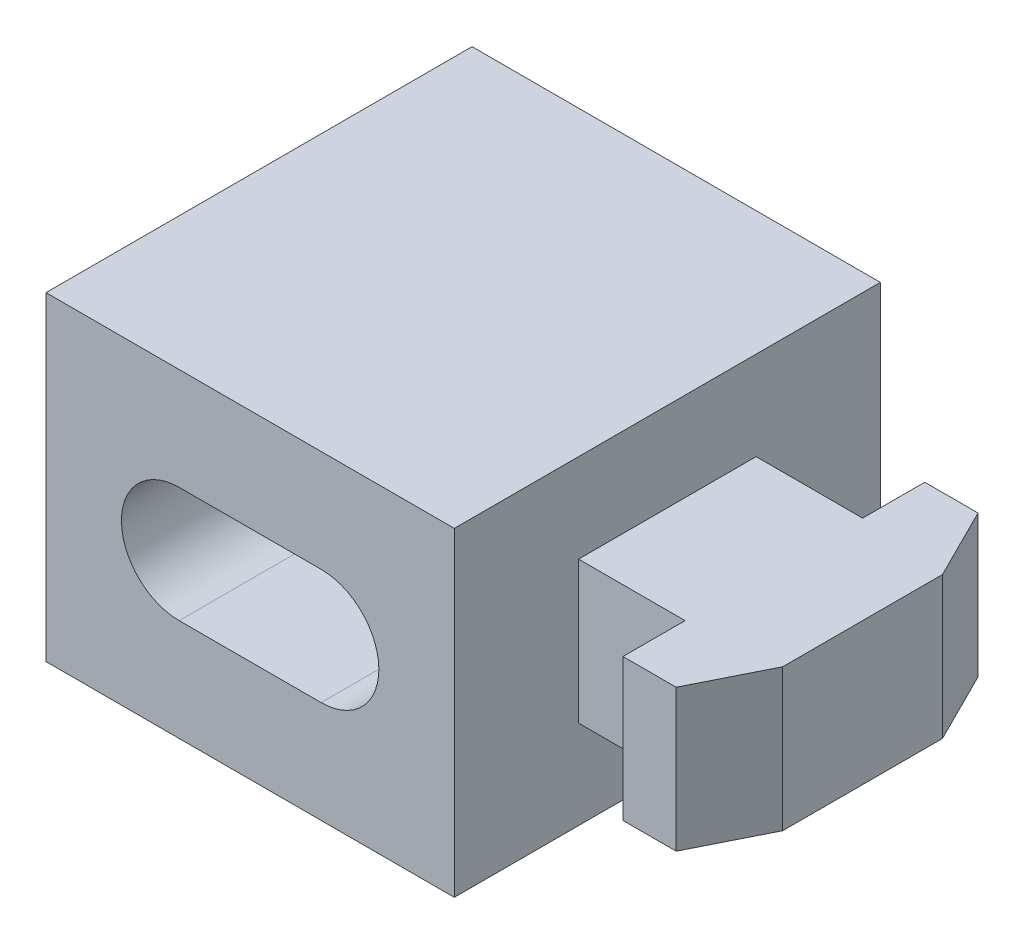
ISO-10303-21;
HEADER;
FILE_DESCRIPTION(('STEP AP214'),'2;1');
FILE_NAME('part.step','',(''),(''),'','','');
FILE_SCHEMA(('AUTOMOTIVE_DESIGN { 1 0 10303 214 1 1 1 1 }'));
ENDSEC;
DATA;
#1=APPLICATION_CONTEXT('core data for automotive mechanical design processes');
#2=APPLICATION_PROTOCOL_DEFINITION('international standard','automotive_design',2000,#1);
#3=PRODUCT_CONTEXT('',#1,'mechanical');
#4=PRODUCT('Part','Part','',(#3));
#5=PRODUCT_RELATED_PRODUCT_CATEGORY('part','',(#4));
#6=PRODUCT_DEFINITION_FORMATION('','',#4);
#7=PRODUCT_DEFINITION_CONTEXT('part definition',#1,'design');
#8=PRODUCT_DEFINITION('design','',#6,#7);
#9=PRODUCT_DEFINITION_SHAPE('','',#8);
#10=(LENGTH_UNIT() NAMED_UNIT(*) SI_UNIT(.MILLI.,.METRE.));
#11=(NAMED_UNIT(*) PLANE_ANGLE_UNIT() SI_UNIT($,.RADIAN.));
#12=(NAMED_UNIT(*) SI_UNIT($,.STERADIAN.) SOLID_ANGLE_UNIT());
#13=UNCERTAINTY_MEASURE_WITH_UNIT(LENGTH_MEASURE(1.E-05),#10,'distance_accuracy_value','');
#14=(GEOMETRIC_REPRESENTATION_CONTEXT(3) GLOBAL_UNCERTAINTY_ASSIGNED_CONTEXT((#13)) GLOBAL_UNIT_ASSIGNED_CONTEXT((#10,
#11,#12)) REPRESENTATION_CONTEXT('',''));
#15=CARTESIAN_POINT('',(0.,0.,0.));
#16=DIRECTION('',(0.,0.,1.));
#17=DIRECTION('',(1.,0.,0.));
#18=AXIS2_PLACEMENT_3D('',#15,#16,#17);
#19=CARTESIAN_POINT('',(22.5,-4.,8.5));
#20=DIRECTION('',(0.,1.,0.));
#21=DIRECTION('',(-1.,0.,0.));
#22=AXIS2_PLACEMENT_3D('',#19,#20,#21);
#23=PLANE('',#22);
#24=DIRECTION('',(0.447213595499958,0.,0.894427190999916));
#25=VECTOR('',#24,1.);
#26=CARTESIAN_POINT('',(22.5,-4.,-4.5));
#27=LINE('',#26,#25);
#28=CARTESIAN_POINT('',(20.5,-4.,-8.5));
#29=VERTEX_POINT('',#28);
#30=CARTESIAN_POINT('',(22.5,-4.,-4.5));
#31=VERTEX_POINT('',#30);
#32=EDGE_CURVE('E205',#29,#31,#27,.T.);
#33=ORIENTED_EDGE('',*,*,#32,.T.);
#34=DIRECTION('',(0.,0.,-1.));
#35=VECTOR('',#34,1.);
#36=CARTESIAN_POINT('',(22.5,-4.,8.5));
#37=LINE('',#36,#35);
#38=CARTESIAN_POINT('',(22.5,-4.,4.5));
#39=VERTEX_POINT('',#38);
#40=EDGE_CURVE('E395',#39,#31,#37,.T.);
#41=ORIENTED_EDGE('',*,*,#40,.F.);
#42=DIRECTION('',(0.447213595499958,0.,-0.894427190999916));
#43=VECTOR('',#42,1.);
#44=CARTESIAN_POINT('',(22.5,-4.,4.5));
#45=LINE('',#44,#43);
#46=CARTESIAN_POINT('',(20.5,-4.,8.5));
#47=VERTEX_POINT('',#46);
#48=EDGE_CURVE('E56',#47,#39,#45,.T.);
#49=ORIENTED_EDGE('',*,*,#48,.F.);
#50=DIRECTION('',(-1.,0.,0.));
#51=VECTOR('',#50,1.);
#52=CARTESIAN_POINT('',(22.5,-4.,8.5));
#53=LINE('',#52,#51);
#54=CARTESIAN_POINT('',(17.5,-4.,8.5));
#55=VERTEX_POINT('',#54);
#56=EDGE_CURVE('E225',#47,#55,#53,.T.);
#57=ORIENTED_EDGE('',*,*,#56,.T.);
#58=DIRECTION('',(0.,0.,1.));
#59=VECTOR('',#58,1.);
#60=CARTESIAN_POINT('',(17.5,-4.,8.5));
#61=LINE('',#60,#59);
#62=CARTESIAN_POINT('',(17.5,-4.,5.));
#63=VERTEX_POINT('',#62);
#64=EDGE_CURVE('E370',#63,#55,#61,.T.);
#65=ORIENTED_EDGE('',*,*,#64,.F.);
#66=DIRECTION('',(1.,0.,0.));
#67=VECTOR('',#66,1.);
#68=CARTESIAN_POINT('',(22.5,-4.,5.));
#69=LINE('',#68,#67);
#70=CARTESIAN_POINT('',(11.5,-4.,5.));
#71=VERTEX_POINT('',#70);
#72=EDGE_CURVE('E377',#71,#63,#69,.T.);
#73=ORIENTED_EDGE('',*,*,#72,.F.);
#74=DIRECTION('',(0.,0.,-1.));
#75=VECTOR('',#74,1.);
#76=CARTESIAN_POINT('',(11.5,-4.,8.5));
#77=LINE('',#76,#75);
#78=CARTESIAN_POINT('',(11.5,-4.,-5.));
#79=VERTEX_POINT('',#78);
#80=EDGE_CURVE('E394',#71,#79,#77,.T.);
#81=ORIENTED_EDGE('',*,*,#80,.T.);
#82=DIRECTION('',(1.,0.,0.));
#83=VECTOR('',#82,1.);
#84=CARTESIAN_POINT('',(22.5,-4.,-5.));
#85=LINE('',#84,#83);
#86=CARTESIAN_POINT('',(17.5,-4.,-5.));
#87=VERTEX_POINT('',#86);
#88=EDGE_CURVE('E388',#79,#87,#85,.T.);
#89=ORIENTED_EDGE('',*,*,#88,.T.);
#90=DIRECTION('',(0.,0.,-1.));
#91=VECTOR('',#90,1.);
#92=CARTESIAN_POINT('',(17.5,-4.,8.5));
#93=LINE('',#92,#91);
#94=CARTESIAN_POINT('',(17.5,-4.,-8.5));
#95=VERTEX_POINT('',#94);
#96=EDGE_CURVE('E224',#87,#95,#93,.T.);
#97=ORIENTED_EDGE('',*,*,#96,.T.);
#98=DIRECTION('',(-1.,0.,0.));
#99=VECTOR('',#98,1.);
#100=CARTESIAN_POINT('',(22.5,-4.,-8.5));
#101=LINE('',#100,#99);
#102=EDGE_CURVE('E218',#29,#95,#101,.T.);
#103=ORIENTED_EDGE('',*,*,#102,.F.);
#104=EDGE_LOOP('',(#33,#41,#49,#57,#65,#73,#81,#89,#97,#103));
#105=FACE_BOUND('',#104,.T.);
#106=ADVANCED_FACE('F34',(#105),#23,.F.);
#107=CARTESIAN_POINT('',(22.5,4.,8.5));
#108=DIRECTION('',(0.,-1.,0.));
#109=DIRECTION('',(1.,0.,0.));
#110=AXIS2_PLACEMENT_3D('',#107,#108,#109);
#111=PLANE('',#110);
#112=DIRECTION('',(0.447213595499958,0.,0.894427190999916));
#113=VECTOR('',#112,1.);
#114=CARTESIAN_POINT('',(27.7,4.00000000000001,5.9));
#115=LINE('',#114,#113);
#116=CARTESIAN_POINT('',(20.5,4.,-8.5));
#117=VERTEX_POINT('',#116);
#118=CARTESIAN_POINT('',(22.5,4.,-4.49999999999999));
#119=VERTEX_POINT('',#118);
#120=EDGE_CURVE('E49',#117,#119,#115,.T.);
#121=ORIENTED_EDGE('',*,*,#120,.F.);
#122=DIRECTION('',(-1.,0.,0.));
#123=VECTOR('',#122,1.);
#124=CARTESIAN_POINT('',(22.5,4.,-8.5));
#125=LINE('',#124,#123);
#126=CARTESIAN_POINT('',(17.5,4.,-8.5));
#127=VERTEX_POINT('',#126);
#128=EDGE_CURVE('E220',#117,#127,#125,.T.);
#129=ORIENTED_EDGE('',*,*,#128,.T.);
#130=DIRECTION('',(0.,0.,-1.));
#131=VECTOR('',#130,1.);
#132=CARTESIAN_POINT('',(17.5,4.,-8.5));
#133=LINE('',#132,#131);
#134=CARTESIAN_POINT('',(17.5,4.,-5.));
#135=VERTEX_POINT('',#134);
#136=EDGE_CURVE('E382',#135,#127,#133,.T.);
#137=ORIENTED_EDGE('',*,*,#136,.F.);
#138=DIRECTION('',(1.,0.,0.));
#139=VECTOR('',#138,1.);
#140=CARTESIAN_POINT('',(11.5,4.,-5.));
#141=LINE('',#140,#139);
#142=CARTESIAN_POINT('',(11.5,4.,-5.));
#143=VERTEX_POINT('',#142);
#144=EDGE_CURVE('E379',#143,#135,#141,.T.);
#145=ORIENTED_EDGE('',*,*,#144,.F.);
#146=DIRECTION('',(0.,0.,1.));
#147=VECTOR('',#146,1.);
#148=CARTESIAN_POINT('',(11.5,4.,8.5));
#149=LINE('',#148,#147);
#150=CARTESIAN_POINT('',(11.5,4.,5.));
#151=VERTEX_POINT('',#150);
#152=EDGE_CURVE('E397',#143,#151,#149,.T.);
#153=ORIENTED_EDGE('',*,*,#152,.T.);
#154=DIRECTION('',(1.,0.,0.));
#155=VECTOR('',#154,1.);
#156=CARTESIAN_POINT('',(11.5,4.,5.));
#157=LINE('',#156,#155);
#158=CARTESIAN_POINT('',(17.5,4.,5.));
#159=VERTEX_POINT('',#158);
#160=EDGE_CURVE('E360',#151,#159,#157,.T.);
#161=ORIENTED_EDGE('',*,*,#160,.T.);
#162=DIRECTION('',(0.,0.,1.));
#163=VECTOR('',#162,1.);
#164=CARTESIAN_POINT('',(17.5,4.,8.5));
#165=LINE('',#164,#163);
#166=CARTESIAN_POINT('',(17.5,4.,8.5));
#167=VERTEX_POINT('',#166);
#168=EDGE_CURVE('E357',#159,#167,#165,.T.);
#169=ORIENTED_EDGE('',*,*,#168,.T.);
#170=DIRECTION('',(-1.,0.,0.));
#171=VECTOR('',#170,1.);
#172=CARTESIAN_POINT('',(22.5,4.,8.5));
#173=LINE('',#172,#171);
#174=CARTESIAN_POINT('',(20.5,4.,8.5));
#175=VERTEX_POINT('',#174);
#176=EDGE_CURVE('E229',#175,#167,#173,.T.);
#177=ORIENTED_EDGE('',*,*,#176,.F.);
#178=DIRECTION('',(0.447213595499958,0.,-0.894427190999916));
#179=VECTOR('',#178,1.);
#180=CARTESIAN_POINT('',(20.9,4.,7.7));
#181=LINE('',#180,#179);
#182=CARTESIAN_POINT('',(22.5,4.,4.5));
#183=VERTEX_POINT('',#182);
#184=EDGE_CURVE('E348',#175,#183,#181,.T.);
#185=ORIENTED_EDGE('',*,*,#184,.T.);
#186=DIRECTION('',(0.,0.,1.));
#187=VECTOR('',#186,1.);
#188=CARTESIAN_POINT('',(22.5,4.,8.5));
#189=LINE('',#188,#187);
#190=EDGE_CURVE('E355',#119,#183,#189,.T.);
#191=ORIENTED_EDGE('',*,*,#190,.F.);
#192=EDGE_LOOP('',(#121,#129,#137,#145,#153,#161,#169,#177,#185,#191));
#193=FACE_BOUND('',#192,.T.);
#194=ADVANCED_FACE('F354',(#193),#111,.F.);
#195=CARTESIAN_POINT('',(22.5,4.,-8.5));
#196=DIRECTION('',(0.,0.,1.));
#197=DIRECTION('',(1.,0.,0.));
#198=AXIS2_PLACEMENT_3D('',#195,#196,#197);
#199=PLANE('',#198);
#200=DIRECTION('',(0.,-1.,0.));
#201=VECTOR('',#200,1.);
#202=CARTESIAN_POINT('',(20.5,7.,-8.5));
#203=LINE('',#202,#201);
#204=EDGE_CURVE('E208',#117,#29,#203,.T.);
#205=ORIENTED_EDGE('',*,*,#204,.T.);
#206=ORIENTED_EDGE('',*,*,#102,.T.);
#207=DIRECTION('',(0.,1.,0.));
#208=VECTOR('',#207,1.);
#209=CARTESIAN_POINT('',(17.5,-9.00000000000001,-8.5));
#210=LINE('',#209,#208);
#211=EDGE_CURVE('E386',#95,#127,#210,.T.);
#212=ORIENTED_EDGE('',*,*,#211,.T.);
#213=ORIENTED_EDGE('',*,*,#128,.F.);
#214=EDGE_LOOP('',(#205,#206,#212,#213));
#215=FACE_BOUND('',#214,.T.);
#216=ADVANCED_FACE('F216',(#215),#199,.F.);
#217=CARTESIAN_POINT('',(22.5,0.,0.));
#218=DIRECTION('',(1.,0.,0.));
#219=DIRECTION('',(0.,0.,-1.));
#220=AXIS2_PLACEMENT_3D('',#217,#218,#219);
#221=PLANE('',#220);
#222=ORIENTED_EDGE('',*,*,#40,.T.);
#223=DIRECTION('',(0.,1.,0.));
#224=VECTOR('',#223,1.);
#225=CARTESIAN_POINT('',(22.5,0.,-4.49999999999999));
#226=LINE('',#225,#224);
#227=EDGE_CURVE('E11',#31,#119,#226,.T.);
#228=ORIENTED_EDGE('',*,*,#227,.T.);
#229=ORIENTED_EDGE('',*,*,#190,.T.);
#230=DIRECTION('',(0.,1.,0.));
#231=VECTOR('',#230,1.);
#232=CARTESIAN_POINT('',(22.5,0.,4.49999999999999));
#233=LINE('',#232,#231);
#234=EDGE_CURVE('E42',#39,#183,#233,.T.);
#235=ORIENTED_EDGE('',*,*,#234,.F.);
#236=EDGE_LOOP('',(#222,#228,#229,#235));
#237=FACE_BOUND('',#236,.T.);
#238=ADVANCED_FACE('F418',(#237),#221,.T.);
#239=CARTESIAN_POINT('',(22.5,4.,8.5));
#240=DIRECTION('',(0.,0.,-1.));
#241=DIRECTION('',(0.,1.,0.));
#242=AXIS2_PLACEMENT_3D('',#239,#240,#241);
#243=PLANE('',#242);
#244=ORIENTED_EDGE('',*,*,#56,.F.);
#245=DIRECTION('',(0.,-1.,0.));
#246=VECTOR('',#245,1.);
#247=CARTESIAN_POINT('',(20.5,7.,8.5));
#248=LINE('',#247,#246);
#249=EDGE_CURVE('E358',#175,#47,#248,.T.);
#250=ORIENTED_EDGE('',*,*,#249,.F.);
#251=ORIENTED_EDGE('',*,*,#176,.T.);
#252=DIRECTION('',(0.,1.,0.));
#253=VECTOR('',#252,1.);
#254=CARTESIAN_POINT('',(17.5,-9.00000000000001,8.5));
#255=LINE('',#254,#253);
#256=EDGE_CURVE('E367',#55,#167,#255,.T.);
#257=ORIENTED_EDGE('',*,*,#256,.F.);
#258=EDGE_LOOP('',(#244,#250,#251,#257));
#259=FACE_BOUND('',#258,.T.);
#260=ADVANCED_FACE('F404',(#259),#243,.F.);
#261=CARTESIAN_POINT('',(11.5,9.,12.));
#262=DIRECTION('',(-1.,0.,0.));
#263=DIRECTION('',(0.,-1.,0.));
#264=AXIS2_PLACEMENT_3D('',#261,#262,#263);
#265=PLANE('',#264);
#266=ORIENTED_EDGE('',*,*,#80,.F.);
#267=DIRECTION('',(0.,1.,0.));
#268=VECTOR('',#267,1.);
#269=CARTESIAN_POINT('',(11.5,-9.00000000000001,5.));
#270=LINE('',#269,#268);
#271=EDGE_CURVE('E368',#71,#151,#270,.T.);
#272=ORIENTED_EDGE('',*,*,#271,.T.);
#273=ORIENTED_EDGE('',*,*,#152,.F.);
#274=DIRECTION('',(0.,1.,0.));
#275=VECTOR('',#274,1.);
#276=CARTESIAN_POINT('',(11.5,-9.00000000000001,-5.));
#277=LINE('',#276,#275);
#278=EDGE_CURVE('E385',#79,#143,#277,.T.);
#279=ORIENTED_EDGE('',*,*,#278,.F.);
#280=EDGE_LOOP('',(#266,#272,#273,#279));
#281=FACE_BOUND('',#280,.T.);
#282=DIRECTION('',(0.,0.,-1.));
#283=VECTOR('',#282,1.);
#284=CARTESIAN_POINT('',(11.5,-9.,12.));
#285=LINE('',#284,#283);
#286=CARTESIAN_POINT('',(11.5,-9.,12.));
#287=VERTEX_POINT('',#286);
#288=CARTESIAN_POINT('',(11.5,-9.,-12.));
#289=VERTEX_POINT('',#288);
#290=EDGE_CURVE('E338',#287,#289,#285,.T.);
#291=ORIENTED_EDGE('',*,*,#290,.T.);
#292=DIRECTION('',(0.,1.,0.));
#293=VECTOR('',#292,1.);
#294=CARTESIAN_POINT('',(11.5,9.,-12.));
#295=LINE('',#294,#293);
#296=CARTESIAN_POINT('',(11.5,9.,-12.));
#297=VERTEX_POINT('',#296);
#298=EDGE_CURVE('E330',#289,#297,#295,.T.);
#299=ORIENTED_EDGE('',*,*,#298,.T.);
#300=DIRECTION('',(0.,0.,-1.));
#301=VECTOR('',#300,1.);
#302=CARTESIAN_POINT('',(11.5,9.,12.));
#303=LINE('',#302,#301);
#304=CARTESIAN_POINT('',(11.5,9.,12.));
#305=VERTEX_POINT('',#304);
#306=EDGE_CURVE('E335',#305,#297,#303,.T.);
#307=ORIENTED_EDGE('',*,*,#306,.F.);
#308=DIRECTION('',(0.,1.,0.));
#309=VECTOR('',#308,1.);
#310=CARTESIAN_POINT('',(11.5,9.,12.));
#311=LINE('',#310,#309);
#312=EDGE_CURVE('E320',#287,#305,#311,.T.);
#313=ORIENTED_EDGE('',*,*,#312,.F.);
#314=EDGE_LOOP('',(#291,#299,#307,#313));
#315=FACE_BOUND('',#314,.T.);
#316=ADVANCED_FACE('F425',(#281,#315),#265,.F.);
#317=CARTESIAN_POINT('',(-4.,0.,12.));
#318=DIRECTION('',(0.,0.,-1.));
#319=DIRECTION('',(-1.,0.,0.));
#320=AXIS2_PLACEMENT_3D('',#317,#318,#319);
#321=CYLINDRICAL_SURFACE('',#320,3.25);
#322=CARTESIAN_POINT('',(-4.,0.,-2.5));
#323=DIRECTION('',(0.,0.,-1.));
#324=DIRECTION('',(0.,1.,0.));
#325=AXIS2_PLACEMENT_3D('',#322,#323,#324);
#326=CIRCLE('',#325,3.25);
#327=CARTESIAN_POINT('',(-4.,-3.25,-2.5));
#328=VERTEX_POINT('',#327);
#329=CARTESIAN_POINT('',(-4.,3.25,-2.5));
#330=VERTEX_POINT('',#329);
#331=EDGE_CURVE('E274',#328,#330,#326,.T.);
#332=ORIENTED_EDGE('',*,*,#331,.F.);
#333=DIRECTION('',(0.,0.,-1.));
#334=VECTOR('',#333,1.);
#335=CARTESIAN_POINT('',(-4.,-3.25,12.));
#336=LINE('',#335,#334);
#337=CARTESIAN_POINT('',(-4.,-3.25,-12.));
#338=VERTEX_POINT('',#337);
#339=EDGE_CURVE('E309',#328,#338,#336,.T.);
#340=ORIENTED_EDGE('',*,*,#339,.T.);
#341=CARTESIAN_POINT('',(-4.,0.,-12.));
#342=DIRECTION('',(0.,0.,1.));
#343=DIRECTION('',(1.,0.,0.));
#344=AXIS2_PLACEMENT_3D('',#341,#342,#343);
#345=CIRCLE('',#344,3.25);
#346=CARTESIAN_POINT('',(-4.,3.25,-12.));
#347=VERTEX_POINT('',#346);
#348=EDGE_CURVE('E276',#347,#338,#345,.T.);
#349=ORIENTED_EDGE('',*,*,#348,.F.);
#350=DIRECTION('',(0.,0.,-1.));
#351=VECTOR('',#350,1.);
#352=CARTESIAN_POINT('',(-4.,3.25,12.));
#353=LINE('',#352,#351);
#354=EDGE_CURVE('E287',#330,#347,#353,.T.);
#355=ORIENTED_EDGE('',*,*,#354,.F.);
#356=EDGE_LOOP('',(#332,#340,#349,#355));
#357=FACE_BOUND('',#356,.T.);
#358=ADVANCED_FACE('F477',(#357),#321,.F.);
#359=CARTESIAN_POINT('',(-4.,-3.25,12.));
#360=DIRECTION('',(0.,1.,0.));
#361=DIRECTION('',(0.,0.,1.));
#362=AXIS2_PLACEMENT_3D('',#359,#360,#361);
#363=PLANE('',#362);
#364=DIRECTION('',(-1.,0.,0.));
#365=VECTOR('',#364,1.);
#366=CARTESIAN_POINT('',(-4.,-3.25,-2.5));
#367=LINE('',#366,#365);
#368=CARTESIAN_POINT('',(4.,-3.25,-2.5));
#369=VERTEX_POINT('',#368);
#370=EDGE_CURVE('E272',#369,#328,#367,.T.);
#371=ORIENTED_EDGE('',*,*,#370,.F.);
#372=DIRECTION('',(0.,0.,-1.));
#373=VECTOR('',#372,1.);
#374=CARTESIAN_POINT('',(4.,-3.25,12.));
#375=LINE('',#374,#373);
#376=CARTESIAN_POINT('',(4.,-3.25,-12.));
#377=VERTEX_POINT('',#376);
#378=EDGE_CURVE('E305',#369,#377,#375,.T.);
#379=ORIENTED_EDGE('',*,*,#378,.T.);
#380=DIRECTION('',(1.,0.,0.));
#381=VECTOR('',#380,1.);
#382=CARTESIAN_POINT('',(-4.,-3.25,-12.));
#383=LINE('',#382,#381);
#384=EDGE_CURVE('E290',#338,#377,#383,.T.);
#385=ORIENTED_EDGE('',*,*,#384,.F.);
#386=ORIENTED_EDGE('',*,*,#339,.F.);
#387=EDGE_LOOP('',(#371,#379,#385,#386));
#388=FACE_BOUND('',#387,.T.);
#389=ADVANCED_FACE('F472',(#388),#363,.T.);
#390=CARTESIAN_POINT('',(4.,0.,12.));
#391=DIRECTION('',(0.,0.,-1.));
#392=DIRECTION('',(-1.,0.,0.));
#393=AXIS2_PLACEMENT_3D('',#390,#391,#392);
#394=CYLINDRICAL_SURFACE('',#393,3.25);
#395=CARTESIAN_POINT('',(4.,0.,-2.5));
#396=DIRECTION('',(0.,0.,-1.));
#397=DIRECTION('',(0.,1.,0.));
#398=AXIS2_PLACEMENT_3D('',#395,#396,#397);
#399=CIRCLE('',#398,3.25);
#400=CARTESIAN_POINT('',(4.,3.25,-2.5));
#401=VERTEX_POINT('',#400);
#402=EDGE_CURVE('E270',#401,#369,#399,.T.);
#403=ORIENTED_EDGE('',*,*,#402,.F.);
#404=DIRECTION('',(0.,0.,-1.));
#405=VECTOR('',#404,1.);
#406=CARTESIAN_POINT('',(4.,3.25,12.));
#407=LINE('',#406,#405);
#408=CARTESIAN_POINT('',(4.,3.25,-12.));
#409=VERTEX_POINT('',#408);
#410=EDGE_CURVE('E301',#401,#409,#407,.T.);
#411=ORIENTED_EDGE('',*,*,#410,.T.);
#412=CARTESIAN_POINT('',(4.,0.,-12.));
#413=DIRECTION('',(0.,0.,1.));
#414=DIRECTION('',(1.,0.,0.));
#415=AXIS2_PLACEMENT_3D('',#412,#413,#414);
#416=CIRCLE('',#415,3.25);
#417=EDGE_CURVE('E293',#377,#409,#416,.T.);
#418=ORIENTED_EDGE('',*,*,#417,.F.);
#419=ORIENTED_EDGE('',*,*,#378,.F.);
#420=EDGE_LOOP('',(#403,#411,#418,#419));
#421=FACE_BOUND('',#420,.T.);
#422=ADVANCED_FACE('F467',(#421),#394,.F.);
#423=CARTESIAN_POINT('',(-4.,3.25,12.));
#424=DIRECTION('',(0.,-1.,0.));
#425=DIRECTION('',(0.,0.,-1.));
#426=AXIS2_PLACEMENT_3D('',#423,#424,#425);
#427=PLANE('',#426);
#428=DIRECTION('',(1.,0.,0.));
#429=VECTOR('',#428,1.);
#430=CARTESIAN_POINT('',(-4.,3.25,-2.5));
#431=LINE('',#430,#429);
#432=EDGE_CURVE('E345',#330,#401,#431,.T.);
#433=ORIENTED_EDGE('',*,*,#432,.F.);
#434=ORIENTED_EDGE('',*,*,#354,.T.);
#435=DIRECTION('',(-1.,0.,0.));
#436=VECTOR('',#435,1.);
#437=CARTESIAN_POINT('',(-4.,3.25,-12.));
#438=LINE('',#437,#436);
#439=EDGE_CURVE('E280',#409,#347,#438,.T.);
#440=ORIENTED_EDGE('',*,*,#439,.F.);
#441=ORIENTED_EDGE('',*,*,#410,.F.);
#442=EDGE_LOOP('',(#433,#434,#440,#441));
#443=FACE_BOUND('',#442,.T.);
#444=ADVANCED_FACE('F462',(#443),#427,.T.);
#445=CARTESIAN_POINT('',(0.,0.,12.));
#446=DIRECTION('',(0.,0.,1.));
#447=DIRECTION('',(1.,0.,0.));
#448=AXIS2_PLACEMENT_3D('',#445,#446,#447);
#449=PLANE('',#448);
#450=DIRECTION('',(0.,-1.,0.));
#451=VECTOR('',#450,1.);
#452=CARTESIAN_POINT('',(-11.5,9.,12.));
#453=LINE('',#452,#451);
#454=CARTESIAN_POINT('',(-11.5,9.,12.));
#455=VERTEX_POINT('',#454);
#456=CARTESIAN_POINT('',(-11.5,-9.,12.));
#457=VERTEX_POINT('',#456);
#458=EDGE_CURVE('E314',#455,#457,#453,.T.);
#459=ORIENTED_EDGE('',*,*,#458,.T.);
#460=DIRECTION('',(1.,0.,0.));
#461=VECTOR('',#460,1.);
#462=CARTESIAN_POINT('',(-11.5,-9.,12.));
#463=LINE('',#462,#461);
#464=EDGE_CURVE('E317',#457,#287,#463,.T.);
#465=ORIENTED_EDGE('',*,*,#464,.T.);
#466=ORIENTED_EDGE('',*,*,#312,.T.);
#467=DIRECTION('',(-1.,0.,0.));
#468=VECTOR('',#467,1.);
#469=CARTESIAN_POINT('',(-11.5,9.,12.));
#470=LINE('',#469,#468);
#471=EDGE_CURVE('E322',#305,#455,#470,.T.);
#472=ORIENTED_EDGE('',*,*,#471,.T.);
#473=EDGE_LOOP('',(#459,#465,#466,#472));
#474=FACE_BOUND('',#473,.T.);
#475=DIRECTION('',(1.,0.,0.));
#476=VECTOR('',#475,1.);
#477=CARTESIAN_POINT('',(-4.,-3.25,12.));
#478=LINE('',#477,#476);
#479=CARTESIAN_POINT('',(-4.,-3.25,12.));
#480=VERTEX_POINT('',#479);
#481=CARTESIAN_POINT('',(4.,-3.25,12.));
#482=VERTEX_POINT('',#481);
#483=EDGE_CURVE('E279',#480,#482,#478,.T.);
#484=ORIENTED_EDGE('',*,*,#483,.F.);
#485=CARTESIAN_POINT('',(-4.,0.,12.));
#486=DIRECTION('',(0.,0.,1.));
#487=DIRECTION('',(1.,0.,0.));
#488=AXIS2_PLACEMENT_3D('',#485,#486,#487);
#489=CIRCLE('',#488,3.25);
#490=CARTESIAN_POINT('',(-4.,3.25,12.));
#491=VERTEX_POINT('',#490);
#492=EDGE_CURVE('E277',#491,#480,#489,.T.);
#493=ORIENTED_EDGE('',*,*,#492,.F.);
#494=DIRECTION('',(-1.,0.,0.));
#495=VECTOR('',#494,1.);
#496=CARTESIAN_POINT('',(-4.,3.25,12.));
#497=LINE('',#496,#495);
#498=CARTESIAN_POINT('',(4.,3.25,12.));
#499=VERTEX_POINT('',#498);
#500=EDGE_CURVE('E285',#499,#491,#497,.T.);
#501=ORIENTED_EDGE('',*,*,#500,.F.);
#502=CARTESIAN_POINT('',(4.,0.,12.));
#503=DIRECTION('',(0.,0.,1.));
#504=DIRECTION('',(1.,0.,0.));
#505=AXIS2_PLACEMENT_3D('',#502,#503,#504);
#506=CIRCLE('',#505,3.25);
#507=EDGE_CURVE('E282',#482,#499,#506,.T.);
#508=ORIENTED_EDGE('',*,*,#507,.F.);
#509=EDGE_LOOP('',(#484,#493,#501,#508));
#510=FACE_BOUND('',#509,.T.);
#511=ADVANCED_FACE('F478',(#474,#510),#449,.T.);
#512=CARTESIAN_POINT('',(0.,0.,-12.));
#513=DIRECTION('',(0.,0.,1.));
#514=DIRECTION('',(1.,0.,0.));
#515=AXIS2_PLACEMENT_3D('',#512,#513,#514);
#516=PLANE('',#515);
#517=DIRECTION('',(0.,-1.,0.));
#518=VECTOR('',#517,1.);
#519=CARTESIAN_POINT('',(-11.5,9.,-12.));
#520=LINE('',#519,#518);
#521=CARTESIAN_POINT('',(-11.5,9.,-12.));
#522=VERTEX_POINT('',#521);
#523=CARTESIAN_POINT('',(-11.5,-9.,-12.));
#524=VERTEX_POINT('',#523);
#525=EDGE_CURVE('E313',#522,#524,#520,.T.);
#526=ORIENTED_EDGE('',*,*,#525,.F.);
#527=DIRECTION('',(-1.,0.,0.));
#528=VECTOR('',#527,1.);
#529=CARTESIAN_POINT('',(-11.5,9.,-12.));
#530=LINE('',#529,#528);
#531=EDGE_CURVE('E318',#297,#522,#530,.T.);
#532=ORIENTED_EDGE('',*,*,#531,.F.);
#533=ORIENTED_EDGE('',*,*,#298,.F.);
#534=DIRECTION('',(1.,0.,0.));
#535=VECTOR('',#534,1.);
#536=CARTESIAN_POINT('',(-11.5,-9.,-12.));
#537=LINE('',#536,#535);
#538=EDGE_CURVE('E327',#524,#289,#537,.T.);
#539=ORIENTED_EDGE('',*,*,#538,.F.);
#540=EDGE_LOOP('',(#526,#532,#533,#539));
#541=FACE_BOUND('',#540,.T.);
#542=ORIENTED_EDGE('',*,*,#348,.T.);
#543=ORIENTED_EDGE('',*,*,#384,.T.);
#544=ORIENTED_EDGE('',*,*,#417,.T.);
#545=ORIENTED_EDGE('',*,*,#439,.T.);
#546=EDGE_LOOP('',(#542,#543,#544,#545));
#547=FACE_BOUND('',#546,.T.);
#548=ADVANCED_FACE('F481',(#541,#547),#516,.F.);
#549=CARTESIAN_POINT('',(-11.5,9.,12.));
#550=DIRECTION('',(1.,0.,0.));
#551=DIRECTION('',(0.,1.,0.));
#552=AXIS2_PLACEMENT_3D('',#549,#550,#551);
#553=PLANE('',#552);
#554=DIRECTION('',(0.,0.,1.));
#555=VECTOR('',#554,1.);
#556=CARTESIAN_POINT('',(-11.5,-5.,-2.5));
#557=LINE('',#556,#555);
#558=CARTESIAN_POINT('',(-11.5,-5.,-2.5));
#559=VERTEX_POINT('',#558);
#560=CARTESIAN_POINT('',(-11.5,-5.,2.5));
#561=VERTEX_POINT('',#560);
#562=EDGE_CURVE('E248',#559,#561,#557,.T.);
#563=ORIENTED_EDGE('',*,*,#562,.F.);
#564=DIRECTION('',(0.,-1.,0.));
#565=VECTOR('',#564,1.);
#566=CARTESIAN_POINT('',(-11.5,5.,-2.5));
#567=LINE('',#566,#565);
#568=CARTESIAN_POINT('',(-11.5,5.,-2.5));
#569=VERTEX_POINT('',#568);
#570=EDGE_CURVE('E227',#569,#559,#567,.T.);
#571=ORIENTED_EDGE('',*,*,#570,.F.);
#572=DIRECTION('',(0.,0.,-1.));
#573=VECTOR('',#572,1.);
#574=CARTESIAN_POINT('',(-11.5,5.,-2.5));
#575=LINE('',#574,#573);
#576=CARTESIAN_POINT('',(-11.5,5.,2.5));
#577=VERTEX_POINT('',#576);
#578=EDGE_CURVE('E237',#577,#569,#575,.T.);
#579=ORIENTED_EDGE('',*,*,#578,.F.);
#580=DIRECTION('',(0.,1.,0.));
#581=VECTOR('',#580,1.);
#582=CARTESIAN_POINT('',(-11.5,5.,2.5));
#583=LINE('',#582,#581);
#584=EDGE_CURVE('E251',#561,#577,#583,.T.);
#585=ORIENTED_EDGE('',*,*,#584,.F.);
#586=EDGE_LOOP('',(#563,#571,#579,#585));
#587=FACE_BOUND('',#586,.T.);
#588=ORIENTED_EDGE('',*,*,#525,.T.);
#589=DIRECTION('',(0.,0.,-1.));
#590=VECTOR('',#589,1.);
#591=CARTESIAN_POINT('',(-11.5,-9.,12.));
#592=LINE('',#591,#590);
#593=EDGE_CURVE('E340',#457,#524,#592,.T.);
#594=ORIENTED_EDGE('',*,*,#593,.F.);
#595=ORIENTED_EDGE('',*,*,#458,.F.);
#596=DIRECTION('',(0.,0.,-1.));
#597=VECTOR('',#596,1.);
#598=CARTESIAN_POINT('',(-11.5,9.,12.));
#599=LINE('',#598,#597);
#600=EDGE_CURVE('E324',#455,#522,#599,.T.);
#601=ORIENTED_EDGE('',*,*,#600,.T.);
#602=EDGE_LOOP('',(#588,#594,#595,#601));
#603=FACE_BOUND('',#602,.T.);
#604=ADVANCED_FACE('F36',(#587,#603),#553,.F.);
#605=CARTESIAN_POINT('',(-11.5,-9.,12.));
#606=DIRECTION('',(0.,1.,0.));
#607=DIRECTION('',(0.,0.,1.));
#608=AXIS2_PLACEMENT_3D('',#605,#606,#607);
#609=PLANE('',#608);
#610=ORIENTED_EDGE('',*,*,#538,.T.);
#611=ORIENTED_EDGE('',*,*,#290,.F.);
#612=ORIENTED_EDGE('',*,*,#464,.F.);
#613=ORIENTED_EDGE('',*,*,#593,.T.);
#614=EDGE_LOOP('',(#610,#611,#612,#613));
#615=FACE_BOUND('',#614,.T.);
#616=ADVANCED_FACE('F488',(#615),#609,.F.);
#617=CARTESIAN_POINT('',(-11.5,9.,12.));
#618=DIRECTION('',(0.,-1.,0.));
#619=DIRECTION('',(1.,0.,0.));
#620=AXIS2_PLACEMENT_3D('',#617,#618,#619);
#621=PLANE('',#620);
#622=ORIENTED_EDGE('',*,*,#531,.T.);
#623=ORIENTED_EDGE('',*,*,#600,.F.);
#624=ORIENTED_EDGE('',*,*,#471,.F.);
#625=ORIENTED_EDGE('',*,*,#306,.T.);
#626=EDGE_LOOP('',(#622,#623,#624,#625));
#627=FACE_BOUND('',#626,.T.);
#628=ADVANCED_FACE('F475',(#627),#621,.F.);
#629=CARTESIAN_POINT('',(-4.,0.,2.5));
#630=DIRECTION('',(0.,0.,1.));
#631=DIRECTION('',(0.,-1.,0.));
#632=AXIS2_PLACEMENT_3D('',#629,#630,#631);
#633=CIRCLE('',#632,3.25);
#634=CARTESIAN_POINT('',(-4.,3.25,2.5));
#635=VERTEX_POINT('',#634);
#636=CARTESIAN_POINT('',(-4.,-3.25,2.5));
#637=VERTEX_POINT('',#636);
#638=EDGE_CURVE('E268',#635,#637,#633,.T.);
#639=ORIENTED_EDGE('',*,*,#638,.F.);
#640=EDGE_CURVE('E298',#491,#635,#353,.T.);
#641=ORIENTED_EDGE('',*,*,#640,.F.);
#642=ORIENTED_EDGE('',*,*,#492,.T.);
#643=EDGE_CURVE('E310',#480,#637,#336,.T.);
#644=ORIENTED_EDGE('',*,*,#643,.T.);
#645=EDGE_LOOP('',(#639,#641,#642,#644));
#646=FACE_BOUND('',#645,.T.);
#647=ADVANCED_FACE('F470',(#646),#321,.F.);
#648=DIRECTION('',(1.,0.,0.));
#649=VECTOR('',#648,1.);
#650=CARTESIAN_POINT('',(-4.,-3.25,2.5));
#651=LINE('',#650,#649);
#652=CARTESIAN_POINT('',(4.,-3.25,2.5));
#653=VERTEX_POINT('',#652);
#654=EDGE_CURVE('E266',#637,#653,#651,.T.);
#655=ORIENTED_EDGE('',*,*,#654,.F.);
#656=ORIENTED_EDGE('',*,*,#643,.F.);
#657=ORIENTED_EDGE('',*,*,#483,.T.);
#658=EDGE_CURVE('E306',#482,#653,#375,.T.);
#659=ORIENTED_EDGE('',*,*,#658,.T.);
#660=EDGE_LOOP('',(#655,#656,#657,#659));
#661=FACE_BOUND('',#660,.T.);
#662=ADVANCED_FACE('F465',(#661),#363,.T.);
#663=CARTESIAN_POINT('',(4.,0.,2.5));
#664=DIRECTION('',(0.,0.,1.));
#665=DIRECTION('',(0.,-1.,0.));
#666=AXIS2_PLACEMENT_3D('',#663,#664,#665);
#667=CIRCLE('',#666,3.25);
#668=CARTESIAN_POINT('',(4.,3.25,2.5));
#669=VERTEX_POINT('',#668);
#670=EDGE_CURVE('E258',#653,#669,#667,.T.);
#671=ORIENTED_EDGE('',*,*,#670,.F.);
#672=ORIENTED_EDGE('',*,*,#658,.F.);
#673=ORIENTED_EDGE('',*,*,#507,.T.);
#674=EDGE_CURVE('E302',#499,#669,#407,.T.);
#675=ORIENTED_EDGE('',*,*,#674,.T.);
#676=EDGE_LOOP('',(#671,#672,#673,#675));
#677=FACE_BOUND('',#676,.T.);
#678=ADVANCED_FACE('F460',(#677),#394,.F.);
#679=DIRECTION('',(-1.,0.,0.));
#680=VECTOR('',#679,1.);
#681=CARTESIAN_POINT('',(-4.,3.25,2.5));
#682=LINE('',#681,#680);
#683=EDGE_CURVE('E343',#669,#635,#682,.T.);
#684=ORIENTED_EDGE('',*,*,#683,.F.);
#685=ORIENTED_EDGE('',*,*,#674,.F.);
#686=ORIENTED_EDGE('',*,*,#500,.T.);
#687=ORIENTED_EDGE('',*,*,#640,.T.);
#688=EDGE_LOOP('',(#684,#685,#686,#687));
#689=FACE_BOUND('',#688,.T.);
#690=ADVANCED_FACE('F456',(#689),#427,.T.);
#691=CARTESIAN_POINT('',(8.5,5.,-2.5));
#692=DIRECTION('',(0.,0.,-1.));
#693=DIRECTION('',(0.,1.,0.));
#694=AXIS2_PLACEMENT_3D('',#691,#692,#693);
#695=PLANE('',#694);
#696=ORIENTED_EDGE('',*,*,#331,.T.);
#697=ORIENTED_EDGE('',*,*,#432,.T.);
#698=ORIENTED_EDGE('',*,*,#402,.T.);
#699=ORIENTED_EDGE('',*,*,#370,.T.);
#700=EDGE_LOOP('',(#696,#697,#698,#699));
#701=FACE_BOUND('',#700,.T.);
#702=ORIENTED_EDGE('',*,*,#570,.T.);
#703=DIRECTION('',(-1.,0.,0.));
#704=VECTOR('',#703,1.);
#705=CARTESIAN_POINT('',(8.5,-5.,-2.5));
#706=LINE('',#705,#704);
#707=CARTESIAN_POINT('',(8.5,-5.,-2.5));
#708=VERTEX_POINT('',#707);
#709=EDGE_CURVE('E246',#708,#559,#706,.T.);
#710=ORIENTED_EDGE('',*,*,#709,.F.);
#711=DIRECTION('',(0.,-1.,0.));
#712=VECTOR('',#711,1.);
#713=CARTESIAN_POINT('',(8.5,5.,-2.5));
#714=LINE('',#713,#712);
#715=CARTESIAN_POINT('',(8.5,5.,-2.5));
#716=VERTEX_POINT('',#715);
#717=EDGE_CURVE('E233',#716,#708,#714,.T.);
#718=ORIENTED_EDGE('',*,*,#717,.F.);
#719=DIRECTION('',(-1.,0.,0.));
#720=VECTOR('',#719,1.);
#721=CARTESIAN_POINT('',(8.5,5.,-2.5));
#722=LINE('',#721,#720);
#723=EDGE_CURVE('E256',#716,#569,#722,.T.);
#724=ORIENTED_EDGE('',*,*,#723,.T.);
#725=EDGE_LOOP('',(#702,#710,#718,#724));
#726=FACE_BOUND('',#725,.T.);
#727=ADVANCED_FACE('F446',(#701,#726),#695,.F.);
#728=CARTESIAN_POINT('',(8.5,5.,-2.5));
#729=DIRECTION('',(0.,1.,0.));
#730=DIRECTION('',(-1.,0.,0.));
#731=AXIS2_PLACEMENT_3D('',#728,#729,#730);
#732=PLANE('',#731);
#733=ORIENTED_EDGE('',*,*,#578,.T.);
#734=ORIENTED_EDGE('',*,*,#723,.F.);
#735=DIRECTION('',(0.,0.,-1.));
#736=VECTOR('',#735,1.);
#737=CARTESIAN_POINT('',(8.5,5.,-2.5));
#738=LINE('',#737,#736);
#739=CARTESIAN_POINT('',(8.5,5.,2.5));
#740=VERTEX_POINT('',#739);
#741=EDGE_CURVE('E243',#740,#716,#738,.T.);
#742=ORIENTED_EDGE('',*,*,#741,.F.);
#743=DIRECTION('',(-1.,0.,0.));
#744=VECTOR('',#743,1.);
#745=CARTESIAN_POINT('',(8.5,5.,2.5));
#746=LINE('',#745,#744);
#747=EDGE_CURVE('E259',#740,#577,#746,.T.);
#748=ORIENTED_EDGE('',*,*,#747,.T.);
#749=EDGE_LOOP('',(#733,#734,#742,#748));
#750=FACE_BOUND('',#749,.T.);
#751=ADVANCED_FACE('F442',(#750),#732,.F.);
#752=CARTESIAN_POINT('',(8.5,5.,2.5));
#753=DIRECTION('',(0.,0.,1.));
#754=DIRECTION('',(0.,-1.,0.));
#755=AXIS2_PLACEMENT_3D('',#752,#753,#754);
#756=PLANE('',#755);
#757=ORIENTED_EDGE('',*,*,#638,.T.);
#758=ORIENTED_EDGE('',*,*,#654,.T.);
#759=ORIENTED_EDGE('',*,*,#670,.T.);
#760=ORIENTED_EDGE('',*,*,#683,.T.);
#761=EDGE_LOOP('',(#757,#758,#759,#760));
#762=FACE_BOUND('',#761,.T.);
#763=ORIENTED_EDGE('',*,*,#584,.T.);
#764=ORIENTED_EDGE('',*,*,#747,.F.);
#765=DIRECTION('',(0.,1.,0.));
#766=VECTOR('',#765,1.);
#767=CARTESIAN_POINT('',(8.5,5.,2.5));
#768=LINE('',#767,#766);
#769=CARTESIAN_POINT('',(8.5,-5.,2.5));
#770=VERTEX_POINT('',#769);
#771=EDGE_CURVE('E240',#770,#740,#768,.T.);
#772=ORIENTED_EDGE('',*,*,#771,.F.);
#773=DIRECTION('',(-1.,0.,0.));
#774=VECTOR('',#773,1.);
#775=CARTESIAN_POINT('',(8.5,-5.,2.5));
#776=LINE('',#775,#774);
#777=EDGE_CURVE('E261',#770,#561,#776,.T.);
#778=ORIENTED_EDGE('',*,*,#777,.T.);
#779=EDGE_LOOP('',(#763,#764,#772,#778));
#780=FACE_BOUND('',#779,.T.);
#781=ADVANCED_FACE('F445',(#762,#780),#756,.F.);
#782=CARTESIAN_POINT('',(8.5,-5.,-2.5));
#783=DIRECTION('',(0.,-1.,0.));
#784=DIRECTION('',(1.,0.,0.));
#785=AXIS2_PLACEMENT_3D('',#782,#783,#784);
#786=PLANE('',#785);
#787=ORIENTED_EDGE('',*,*,#562,.T.);
#788=ORIENTED_EDGE('',*,*,#777,.F.);
#789=DIRECTION('',(0.,0.,1.));
#790=VECTOR('',#789,1.);
#791=CARTESIAN_POINT('',(8.5,-5.,-2.5));
#792=LINE('',#791,#790);
#793=EDGE_CURVE('E236',#708,#770,#792,.T.);
#794=ORIENTED_EDGE('',*,*,#793,.F.);
#795=ORIENTED_EDGE('',*,*,#709,.T.);
#796=EDGE_LOOP('',(#787,#788,#794,#795));
#797=FACE_BOUND('',#796,.T.);
#798=ADVANCED_FACE('F440',(#797),#786,.F.);
#799=CARTESIAN_POINT('',(8.5,0.,0.));
#800=DIRECTION('',(-1.,0.,0.));
#801=DIRECTION('',(0.,0.,1.));
#802=AXIS2_PLACEMENT_3D('',#799,#800,#801);
#803=PLANE('',#802);
#804=ORIENTED_EDGE('',*,*,#717,.T.);
#805=ORIENTED_EDGE('',*,*,#793,.T.);
#806=ORIENTED_EDGE('',*,*,#771,.T.);
#807=ORIENTED_EDGE('',*,*,#741,.T.);
#808=EDGE_LOOP('',(#804,#805,#806,#807));
#809=FACE_BOUND('',#808,.T.);
#810=ADVANCED_FACE('F436',(#809),#803,.T.);
#811=CARTESIAN_POINT('',(17.5,-9.00000000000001,-8.5));
#812=DIRECTION('',(1.,0.,0.));
#813=DIRECTION('',(0.,1.,0.));
#814=AXIS2_PLACEMENT_3D('',#811,#812,#813);
#815=PLANE('',#814);
#816=DIRECTION('',(0.,1.,0.));
#817=VECTOR('',#816,1.);
#818=CARTESIAN_POINT('',(17.5,-9.00000000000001,-5.));
#819=LINE('',#818,#817);
#820=EDGE_CURVE('E389',#87,#135,#819,.T.);
#821=ORIENTED_EDGE('',*,*,#820,.T.);
#822=ORIENTED_EDGE('',*,*,#136,.T.);
#823=ORIENTED_EDGE('',*,*,#211,.F.);
#824=ORIENTED_EDGE('',*,*,#96,.F.);
#825=EDGE_LOOP('',(#821,#822,#823,#824));
#826=FACE_BOUND('',#825,.T.);
#827=ADVANCED_FACE('F439',(#826),#815,.F.);
#828=CARTESIAN_POINT('',(11.5,-9.00000000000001,-5.));
#829=DIRECTION('',(0.,0.,1.));
#830=DIRECTION('',(1.,0.,0.));
#831=AXIS2_PLACEMENT_3D('',#828,#829,#830);
#832=PLANE('',#831);
#833=ORIENTED_EDGE('',*,*,#278,.T.);
#834=ORIENTED_EDGE('',*,*,#144,.T.);
#835=ORIENTED_EDGE('',*,*,#820,.F.);
#836=ORIENTED_EDGE('',*,*,#88,.F.);
#837=EDGE_LOOP('',(#833,#834,#835,#836));
#838=FACE_BOUND('',#837,.T.);
#839=ADVANCED_FACE('F620',(#838),#832,.F.);
#840=CARTESIAN_POINT('',(11.5,-9.00000000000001,5.));
#841=DIRECTION('',(0.,0.,1.));
#842=DIRECTION('',(1.,0.,0.));
#843=AXIS2_PLACEMENT_3D('',#840,#841,#842);
#844=PLANE('',#843);
#845=ORIENTED_EDGE('',*,*,#72,.T.);
#846=DIRECTION('',(0.,1.,0.));
#847=VECTOR('',#846,1.);
#848=CARTESIAN_POINT('',(17.5,-9.00000000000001,5.));
#849=LINE('',#848,#847);
#850=EDGE_CURVE('E371',#63,#159,#849,.T.);
#851=ORIENTED_EDGE('',*,*,#850,.T.);
#852=ORIENTED_EDGE('',*,*,#160,.F.);
#853=ORIENTED_EDGE('',*,*,#271,.F.);
#854=EDGE_LOOP('',(#845,#851,#852,#853));
#855=FACE_BOUND('',#854,.T.);
#856=ADVANCED_FACE('F414',(#855),#844,.T.);
#857=CARTESIAN_POINT('',(17.5,-9.00000000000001,8.5));
#858=DIRECTION('',(-1.,0.,0.));
#859=DIRECTION('',(0.,-1.,0.));
#860=AXIS2_PLACEMENT_3D('',#857,#858,#859);
#861=PLANE('',#860);
#862=ORIENTED_EDGE('',*,*,#64,.T.);
#863=ORIENTED_EDGE('',*,*,#256,.T.);
#864=ORIENTED_EDGE('',*,*,#168,.F.);
#865=ORIENTED_EDGE('',*,*,#850,.F.);
#866=EDGE_LOOP('',(#862,#863,#864,#865));
#867=FACE_BOUND('',#866,.T.);
#868=ADVANCED_FACE('F407',(#867),#861,.T.);
#869=CARTESIAN_POINT('',(22.5,7.,4.5));
#870=DIRECTION('',(-0.894427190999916,0.,-0.447213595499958));
#871=DIRECTION('',(-0.447213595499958,0.,0.894427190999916));
#872=AXIS2_PLACEMENT_3D('',#869,#870,#871);
#873=PLANE('',#872);
#874=ORIENTED_EDGE('',*,*,#249,.T.);
#875=ORIENTED_EDGE('',*,*,#48,.T.);
#876=ORIENTED_EDGE('',*,*,#234,.T.);
#877=ORIENTED_EDGE('',*,*,#184,.F.);
#878=EDGE_LOOP('',(#874,#875,#876,#877));
#879=FACE_BOUND('',#878,.T.);
#880=ADVANCED_FACE('F347',(#879),#873,.F.);
#881=CARTESIAN_POINT('',(22.5,7.,-4.5));
#882=DIRECTION('',(0.894427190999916,0.,-0.447213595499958));
#883=DIRECTION('',(-0.447213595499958,0.,-0.894427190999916));
#884=AXIS2_PLACEMENT_3D('',#881,#882,#883);
#885=PLANE('',#884);
#886=ORIENTED_EDGE('',*,*,#120,.T.);
#887=ORIENTED_EDGE('',*,*,#227,.F.);
#888=ORIENTED_EDGE('',*,*,#32,.F.);
#889=ORIENTED_EDGE('',*,*,#204,.F.);
#890=EDGE_LOOP('',(#886,#887,#888,#889));
#891=FACE_BOUND('',#890,.T.);
#892=ADVANCED_FACE('F207',(#891),#885,.T.);
#893=CLOSED_SHELL('',(#106,#194,#216,#238,#260,#316,#358,#389,#422,#444,#511,#548,#604,#616,
#628,#647,#662,#678,#690,#727,#751,#781,#798,#810,#827,#839,#856,#868,#880,#892));
#894=MANIFOLD_SOLID_BREP('B2',#893);
#895=ADVANCED_BREP_SHAPE_REPRESENTATION('',(#18,#894),#14);
#896=SHAPE_DEFINITION_REPRESENTATION(#9,#895);
ENDSEC;
END-ISO-10303-21;
